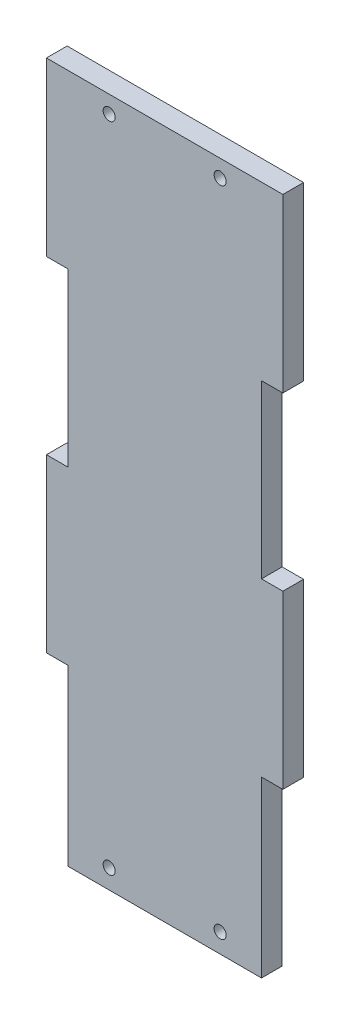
ISO-10303-21;
HEADER;
FILE_DESCRIPTION(('STEP AP214'),'2;1');
FILE_NAME('part.step','',(''),(''),'','','');
FILE_SCHEMA(('AUTOMOTIVE_DESIGN { 1 0 10303 214 1 1 1 1 }'));
ENDSEC;
DATA;
#1=APPLICATION_CONTEXT('core data for automotive mechanical design processes');
#2=APPLICATION_PROTOCOL_DEFINITION('international standard','automotive_design',2000,#1);
#3=PRODUCT_CONTEXT('',#1,'mechanical');
#4=PRODUCT('Part','Part','',(#3));
#5=PRODUCT_RELATED_PRODUCT_CATEGORY('part','',(#4));
#6=PRODUCT_DEFINITION_FORMATION('','',#4);
#7=PRODUCT_DEFINITION_CONTEXT('part definition',#1,'design');
#8=PRODUCT_DEFINITION('design','',#6,#7);
#9=PRODUCT_DEFINITION_SHAPE('','',#8);
#10=(LENGTH_UNIT() NAMED_UNIT(*) SI_UNIT(.MILLI.,.METRE.));
#11=(NAMED_UNIT(*) PLANE_ANGLE_UNIT() SI_UNIT($,.RADIAN.));
#12=(NAMED_UNIT(*) SI_UNIT($,.STERADIAN.) SOLID_ANGLE_UNIT());
#13=UNCERTAINTY_MEASURE_WITH_UNIT(LENGTH_MEASURE(1.E-05),#10,'distance_accuracy_value','');
#14=(GEOMETRIC_REPRESENTATION_CONTEXT(3) GLOBAL_UNCERTAINTY_ASSIGNED_CONTEXT((#13)) GLOBAL_UNIT_ASSIGNED_CONTEXT((#10,
#11,#12)) REPRESENTATION_CONTEXT('',''));
#15=CARTESIAN_POINT('',(0.,0.,0.));
#16=DIRECTION('',(0.,0.,1.));
#17=DIRECTION('',(1.,0.,0.));
#18=AXIS2_PLACEMENT_3D('',#15,#16,#17);
#19=CARTESIAN_POINT('',(0.,0.,6.));
#20=DIRECTION('',(0.,0.,1.));
#21=DIRECTION('',(1.,0.,0.));
#22=AXIS2_PLACEMENT_3D('',#19,#20,#21);
#23=PLANE('',#22);
#24=CARTESIAN_POINT('',(12.,5.60000000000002,6.));
#25=DIRECTION('',(0.,0.,1.));
#26=DIRECTION('',(-1.,0.,0.));
#27=AXIS2_PLACEMENT_3D('',#24,#25,#26);
#28=CIRCLE('',#27,1.75);
#29=CARTESIAN_POINT('',(10.25,5.60000000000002,6.));
#30=VERTEX_POINT('',#29);
#31=EDGE_CURVE('E407',#30,#30,#28,.T.);
#32=ORIENTED_EDGE('',*,*,#31,.F.);
#33=EDGE_LOOP('',(#32));
#34=FACE_BOUND('',#33,.T.);
#35=CARTESIAN_POINT('',(12.,195.,6.));
#36=DIRECTION('',(0.,0.,1.));
#37=DIRECTION('',(1.,0.,0.));
#38=AXIS2_PLACEMENT_3D('',#35,#36,#37);
#39=CIRCLE('',#38,1.75);
#40=CARTESIAN_POINT('',(13.75,195.,6.));
#41=VERTEX_POINT('',#40);
#42=EDGE_CURVE('E204',#41,#41,#39,.T.);
#43=ORIENTED_EDGE('',*,*,#42,.F.);
#44=EDGE_LOOP('',(#43));
#45=FACE_BOUND('',#44,.T.);
#46=DIRECTION('',(0.,-1.,0.));
#47=VECTOR('',#46,1.);
#48=CARTESIAN_POINT('',(0.,0.,6.));
#49=LINE('',#48,#47);
#50=CARTESIAN_POINT('',(0.,50.5,6.));
#51=VERTEX_POINT('',#50);
#52=CARTESIAN_POINT('',(0.,0.,6.));
#53=VERTEX_POINT('',#52);
#54=EDGE_CURVE('E247',#51,#53,#49,.T.);
#55=ORIENTED_EDGE('',*,*,#54,.T.);
#56=DIRECTION('',(1.,0.,0.));
#57=VECTOR('',#56,1.);
#58=CARTESIAN_POINT('',(0.,0.,6.));
#59=LINE('',#58,#57);
#60=CARTESIAN_POINT('',(56.2,0.,6.));
#61=VERTEX_POINT('',#60);
#62=EDGE_CURVE('E134',#53,#61,#59,.T.);
#63=ORIENTED_EDGE('',*,*,#62,.T.);
#64=DIRECTION('',(0.,1.,0.));
#65=VECTOR('',#64,1.);
#66=CARTESIAN_POINT('',(56.2,0.,6.));
#67=LINE('',#66,#65);
#68=CARTESIAN_POINT('',(56.2,50.5,6.));
#69=VERTEX_POINT('',#68);
#70=EDGE_CURVE('E300',#61,#69,#67,.T.);
#71=ORIENTED_EDGE('',*,*,#70,.T.);
#72=DIRECTION('',(1.,0.,0.));
#73=VECTOR('',#72,1.);
#74=CARTESIAN_POINT('',(56.2,50.5,6.));
#75=LINE('',#74,#73);
#76=CARTESIAN_POINT('',(62.4,50.5,6.));
#77=VERTEX_POINT('',#76);
#78=EDGE_CURVE('E320',#69,#77,#75,.T.);
#79=ORIENTED_EDGE('',*,*,#78,.T.);
#80=DIRECTION('',(0.,1.,0.));
#81=VECTOR('',#80,1.);
#82=CARTESIAN_POINT('',(62.4,50.5,6.));
#83=LINE('',#82,#81);
#84=CARTESIAN_POINT('',(62.4,100.3,6.));
#85=VERTEX_POINT('',#84);
#86=EDGE_CURVE('E316',#77,#85,#83,.T.);
#87=ORIENTED_EDGE('',*,*,#86,.T.);
#88=DIRECTION('',(-1.,0.,0.));
#89=VECTOR('',#88,1.);
#90=CARTESIAN_POINT('',(56.2,100.3,6.));
#91=LINE('',#90,#89);
#92=CARTESIAN_POINT('',(56.2,100.3,6.));
#93=VERTEX_POINT('',#92);
#94=EDGE_CURVE('E319',#85,#93,#91,.T.);
#95=ORIENTED_EDGE('',*,*,#94,.T.);
#96=DIRECTION('',(0.,1.,0.));
#97=VECTOR('',#96,1.);
#98=CARTESIAN_POINT('',(56.2,100.3,6.));
#99=LINE('',#98,#97);
#100=CARTESIAN_POINT('',(56.2,150.1,6.));
#101=VERTEX_POINT('',#100);
#102=EDGE_CURVE('E324',#93,#101,#99,.T.);
#103=ORIENTED_EDGE('',*,*,#102,.T.);
#104=DIRECTION('',(1.,0.,0.));
#105=VECTOR('',#104,1.);
#106=CARTESIAN_POINT('',(56.2,150.1,6.));
#107=LINE('',#106,#105);
#108=CARTESIAN_POINT('',(62.4,150.1,6.));
#109=VERTEX_POINT('',#108);
#110=EDGE_CURVE('E331',#101,#109,#107,.T.);
#111=ORIENTED_EDGE('',*,*,#110,.T.);
#112=DIRECTION('',(0.,1.,0.));
#113=VECTOR('',#112,1.);
#114=CARTESIAN_POINT('',(62.4,200.,6.));
#115=LINE('',#114,#113);
#116=CARTESIAN_POINT('',(62.4,200.,6.));
#117=VERTEX_POINT('',#116);
#118=EDGE_CURVE('E334',#109,#117,#115,.T.);
#119=ORIENTED_EDGE('',*,*,#118,.T.);
#120=DIRECTION('',(-1.,0.,0.));
#121=VECTOR('',#120,1.);
#122=CARTESIAN_POINT('',(56.2,200.,6.));
#123=LINE('',#122,#121);
#124=CARTESIAN_POINT('',(-6.2,200.,6.));
#125=VERTEX_POINT('',#124);
#126=EDGE_CURVE('E337',#117,#125,#123,.T.);
#127=ORIENTED_EDGE('',*,*,#126,.T.);
#128=DIRECTION('',(0.,-1.,0.));
#129=VECTOR('',#128,1.);
#130=CARTESIAN_POINT('',(-6.2,150.1,6.));
#131=LINE('',#130,#129);
#132=CARTESIAN_POINT('',(-6.2,150.1,6.));
#133=VERTEX_POINT('',#132);
#134=EDGE_CURVE('E340',#125,#133,#131,.T.);
#135=ORIENTED_EDGE('',*,*,#134,.T.);
#136=DIRECTION('',(1.,0.,0.));
#137=VECTOR('',#136,1.);
#138=CARTESIAN_POINT('',(0.,150.1,6.));
#139=LINE('',#138,#137);
#140=CARTESIAN_POINT('',(0.,150.1,6.));
#141=VERTEX_POINT('',#140);
#142=EDGE_CURVE('E343',#133,#141,#139,.T.);
#143=ORIENTED_EDGE('',*,*,#142,.T.);
#144=DIRECTION('',(0.,-1.,0.));
#145=VECTOR('',#144,1.);
#146=CARTESIAN_POINT('',(0.,100.3,6.));
#147=LINE('',#146,#145);
#148=CARTESIAN_POINT('',(0.,100.3,6.));
#149=VERTEX_POINT('',#148);
#150=EDGE_CURVE('E177',#141,#149,#147,.T.);
#151=ORIENTED_EDGE('',*,*,#150,.T.);
#152=DIRECTION('',(-1.,0.,0.));
#153=VECTOR('',#152,1.);
#154=CARTESIAN_POINT('',(0.,100.3,6.));
#155=LINE('',#154,#153);
#156=CARTESIAN_POINT('',(-6.2,100.3,6.));
#157=VERTEX_POINT('',#156);
#158=EDGE_CURVE('E171',#149,#157,#155,.T.);
#159=ORIENTED_EDGE('',*,*,#158,.T.);
#160=DIRECTION('',(0.,-1.,0.));
#161=VECTOR('',#160,1.);
#162=CARTESIAN_POINT('',(-6.2,50.5,6.));
#163=LINE('',#162,#161);
#164=CARTESIAN_POINT('',(-6.2,50.5,6.));
#165=VERTEX_POINT('',#164);
#166=EDGE_CURVE('E175',#157,#165,#163,.T.);
#167=ORIENTED_EDGE('',*,*,#166,.T.);
#168=DIRECTION('',(1.,0.,0.));
#169=VECTOR('',#168,1.);
#170=CARTESIAN_POINT('',(0.,50.5,6.));
#171=LINE('',#170,#169);
#172=EDGE_CURVE('E67',#165,#51,#171,.T.);
#173=ORIENTED_EDGE('',*,*,#172,.T.);
#174=EDGE_LOOP('',(#55,#63,#71,#79,#87,#95,#103,#111,#119,#127,#135,#143,#151,#159,#167,#173));
#175=FACE_BOUND('',#174,.T.);
#176=CARTESIAN_POINT('',(44.2,195.,6.));
#177=DIRECTION('',(0.,0.,1.));
#178=DIRECTION('',(-1.,0.,0.));
#179=AXIS2_PLACEMENT_3D('',#176,#177,#178);
#180=CIRCLE('',#179,1.75);
#181=CARTESIAN_POINT('',(42.45,195.,6.));
#182=VERTEX_POINT('',#181);
#183=EDGE_CURVE('E415',#182,#182,#180,.T.);
#184=ORIENTED_EDGE('',*,*,#183,.F.);
#185=EDGE_LOOP('',(#184));
#186=FACE_BOUND('',#185,.T.);
#187=CARTESIAN_POINT('',(44.2,5.60000000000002,6.));
#188=DIRECTION('',(0.,0.,1.));
#189=DIRECTION('',(1.,0.,0.));
#190=AXIS2_PLACEMENT_3D('',#187,#188,#189);
#191=CIRCLE('',#190,1.75);
#192=CARTESIAN_POINT('',(45.95,5.60000000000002,6.));
#193=VERTEX_POINT('',#192);
#194=EDGE_CURVE('E396',#193,#193,#191,.T.);
#195=ORIENTED_EDGE('',*,*,#194,.F.);
#196=EDGE_LOOP('',(#195));
#197=FACE_BOUND('',#196,.T.);
#198=ADVANCED_FACE('F49',(#34,#45,#175,#186,#197),#23,.T.);
#199=CARTESIAN_POINT('',(0.,0.,0.));
#200=DIRECTION('',(0.,0.,1.));
#201=DIRECTION('',(1.,0.,0.));
#202=AXIS2_PLACEMENT_3D('',#199,#200,#201);
#203=PLANE('',#202);
#204=DIRECTION('',(0.,-1.,0.));
#205=VECTOR('',#204,1.);
#206=CARTESIAN_POINT('',(0.,0.,0.));
#207=LINE('',#206,#205);
#208=CARTESIAN_POINT('',(0.,50.5,0.));
#209=VERTEX_POINT('',#208);
#210=CARTESIAN_POINT('',(0.,0.,0.));
#211=VERTEX_POINT('',#210);
#212=EDGE_CURVE('E199',#209,#211,#207,.T.);
#213=ORIENTED_EDGE('',*,*,#212,.F.);
#214=DIRECTION('',(1.,0.,0.));
#215=VECTOR('',#214,1.);
#216=CARTESIAN_POINT('',(0.,50.5,0.));
#217=LINE('',#216,#215);
#218=CARTESIAN_POINT('',(-6.2,50.5,0.));
#219=VERTEX_POINT('',#218);
#220=EDGE_CURVE('E126',#219,#209,#217,.T.);
#221=ORIENTED_EDGE('',*,*,#220,.F.);
#222=DIRECTION('',(0.,-1.,0.));
#223=VECTOR('',#222,1.);
#224=CARTESIAN_POINT('',(-6.2,50.5,0.));
#225=LINE('',#224,#223);
#226=CARTESIAN_POINT('',(-6.2,100.3,0.));
#227=VERTEX_POINT('',#226);
#228=EDGE_CURVE('E120',#227,#219,#225,.T.);
#229=ORIENTED_EDGE('',*,*,#228,.F.);
#230=DIRECTION('',(-1.,0.,0.));
#231=VECTOR('',#230,1.);
#232=CARTESIAN_POINT('',(0.,100.3,0.));
#233=LINE('',#232,#231);
#234=CARTESIAN_POINT('',(0.,100.3,0.));
#235=VERTEX_POINT('',#234);
#236=EDGE_CURVE('E186',#235,#227,#233,.T.);
#237=ORIENTED_EDGE('',*,*,#236,.F.);
#238=DIRECTION('',(0.,-1.,0.));
#239=VECTOR('',#238,1.);
#240=CARTESIAN_POINT('',(0.,100.3,0.));
#241=LINE('',#240,#239);
#242=CARTESIAN_POINT('',(0.,150.1,0.));
#243=VERTEX_POINT('',#242);
#244=EDGE_CURVE('E238',#243,#235,#241,.T.);
#245=ORIENTED_EDGE('',*,*,#244,.F.);
#246=DIRECTION('',(1.,0.,0.));
#247=VECTOR('',#246,1.);
#248=CARTESIAN_POINT('',(0.,150.1,0.));
#249=LINE('',#248,#247);
#250=CARTESIAN_POINT('',(-6.2,150.1,0.));
#251=VERTEX_POINT('',#250);
#252=EDGE_CURVE('E235',#251,#243,#249,.T.);
#253=ORIENTED_EDGE('',*,*,#252,.F.);
#254=DIRECTION('',(0.,-1.,0.));
#255=VECTOR('',#254,1.);
#256=CARTESIAN_POINT('',(-6.2,150.1,0.));
#257=LINE('',#256,#255);
#258=CARTESIAN_POINT('',(-6.2,200.,0.));
#259=VERTEX_POINT('',#258);
#260=EDGE_CURVE('E232',#259,#251,#257,.T.);
#261=ORIENTED_EDGE('',*,*,#260,.F.);
#262=DIRECTION('',(-1.,0.,0.));
#263=VECTOR('',#262,1.);
#264=CARTESIAN_POINT('',(0.,200.,0.));
#265=LINE('',#264,#263);
#266=CARTESIAN_POINT('',(62.4,200.,0.));
#267=VERTEX_POINT('',#266);
#268=EDGE_CURVE('E229',#267,#259,#265,.T.);
#269=ORIENTED_EDGE('',*,*,#268,.F.);
#270=DIRECTION('',(0.,1.,0.));
#271=VECTOR('',#270,1.);
#272=CARTESIAN_POINT('',(62.4,200.,0.));
#273=LINE('',#272,#271);
#274=CARTESIAN_POINT('',(62.4,150.1,0.));
#275=VERTEX_POINT('',#274);
#276=EDGE_CURVE('E225',#275,#267,#273,.T.);
#277=ORIENTED_EDGE('',*,*,#276,.F.);
#278=DIRECTION('',(1.,0.,0.));
#279=VECTOR('',#278,1.);
#280=CARTESIAN_POINT('',(56.2,150.1,0.));
#281=LINE('',#280,#279);
#282=CARTESIAN_POINT('',(56.2,150.1,0.));
#283=VERTEX_POINT('',#282);
#284=EDGE_CURVE('E222',#283,#275,#281,.T.);
#285=ORIENTED_EDGE('',*,*,#284,.F.);
#286=DIRECTION('',(0.,1.,0.));
#287=VECTOR('',#286,1.);
#288=CARTESIAN_POINT('',(56.2,100.3,0.));
#289=LINE('',#288,#287);
#290=CARTESIAN_POINT('',(56.2,100.3,0.));
#291=VERTEX_POINT('',#290);
#292=EDGE_CURVE('E219',#291,#283,#289,.T.);
#293=ORIENTED_EDGE('',*,*,#292,.F.);
#294=DIRECTION('',(-1.,0.,0.));
#295=VECTOR('',#294,1.);
#296=CARTESIAN_POINT('',(56.2,100.3,0.));
#297=LINE('',#296,#295);
#298=CARTESIAN_POINT('',(62.4,100.3,0.));
#299=VERTEX_POINT('',#298);
#300=EDGE_CURVE('E216',#299,#291,#297,.T.);
#301=ORIENTED_EDGE('',*,*,#300,.F.);
#302=DIRECTION('',(0.,1.,0.));
#303=VECTOR('',#302,1.);
#304=CARTESIAN_POINT('',(62.4,50.5,0.));
#305=LINE('',#304,#303);
#306=CARTESIAN_POINT('',(62.4,50.5,0.));
#307=VERTEX_POINT('',#306);
#308=EDGE_CURVE('E213',#307,#299,#305,.T.);
#309=ORIENTED_EDGE('',*,*,#308,.F.);
#310=DIRECTION('',(1.,0.,0.));
#311=VECTOR('',#310,1.);
#312=CARTESIAN_POINT('',(56.2,50.5,0.));
#313=LINE('',#312,#311);
#314=CARTESIAN_POINT('',(56.2,50.5,0.));
#315=VERTEX_POINT('',#314);
#316=EDGE_CURVE('E210',#315,#307,#313,.T.);
#317=ORIENTED_EDGE('',*,*,#316,.F.);
#318=DIRECTION('',(0.,1.,0.));
#319=VECTOR('',#318,1.);
#320=CARTESIAN_POINT('',(56.2,0.,0.));
#321=LINE('',#320,#319);
#322=CARTESIAN_POINT('',(56.2,0.,0.));
#323=VERTEX_POINT('',#322);
#324=EDGE_CURVE('E207',#323,#315,#321,.T.);
#325=ORIENTED_EDGE('',*,*,#324,.F.);
#326=DIRECTION('',(1.,0.,0.));
#327=VECTOR('',#326,1.);
#328=CARTESIAN_POINT('',(0.,0.,0.));
#329=LINE('',#328,#327);
#330=EDGE_CURVE('E203',#211,#323,#329,.T.);
#331=ORIENTED_EDGE('',*,*,#330,.F.);
#332=EDGE_LOOP('',(#213,#221,#229,#237,#245,#253,#261,#269,#277,#285,#293,#301,#309,#317,#325,#331));
#333=FACE_BOUND('',#332,.T.);
#334=CARTESIAN_POINT('',(12.,195.,0.));
#335=DIRECTION('',(0.,0.,1.));
#336=DIRECTION('',(1.,0.,0.));
#337=AXIS2_PLACEMENT_3D('',#334,#335,#336);
#338=CIRCLE('',#337,1.75);
#339=CARTESIAN_POINT('',(13.75,195.,0.));
#340=VERTEX_POINT('',#339);
#341=EDGE_CURVE('E419',#340,#340,#338,.T.);
#342=ORIENTED_EDGE('',*,*,#341,.T.);
#343=EDGE_LOOP('',(#342));
#344=FACE_BOUND('',#343,.T.);
#345=CARTESIAN_POINT('',(44.2,195.,0.));
#346=DIRECTION('',(0.,0.,1.));
#347=DIRECTION('',(-1.,0.,0.));
#348=AXIS2_PLACEMENT_3D('',#345,#346,#347);
#349=CIRCLE('',#348,1.75);
#350=CARTESIAN_POINT('',(42.45,195.,0.));
#351=VERTEX_POINT('',#350);
#352=EDGE_CURVE('E411',#351,#351,#349,.T.);
#353=ORIENTED_EDGE('',*,*,#352,.T.);
#354=EDGE_LOOP('',(#353));
#355=FACE_BOUND('',#354,.T.);
#356=CARTESIAN_POINT('',(12.,5.60000000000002,0.));
#357=DIRECTION('',(0.,0.,1.));
#358=DIRECTION('',(-1.,0.,0.));
#359=AXIS2_PLACEMENT_3D('',#356,#357,#358);
#360=CIRCLE('',#359,1.75);
#361=CARTESIAN_POINT('',(10.25,5.60000000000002,0.));
#362=VERTEX_POINT('',#361);
#363=EDGE_CURVE('E404',#362,#362,#360,.T.);
#364=ORIENTED_EDGE('',*,*,#363,.T.);
#365=EDGE_LOOP('',(#364));
#366=FACE_BOUND('',#365,.T.);
#367=CARTESIAN_POINT('',(44.2,5.60000000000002,0.));
#368=DIRECTION('',(0.,0.,1.));
#369=DIRECTION('',(1.,0.,0.));
#370=AXIS2_PLACEMENT_3D('',#367,#368,#369);
#371=CIRCLE('',#370,1.75);
#372=CARTESIAN_POINT('',(45.95,5.60000000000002,0.));
#373=VERTEX_POINT('',#372);
#374=EDGE_CURVE('E399',#373,#373,#371,.T.);
#375=ORIENTED_EDGE('',*,*,#374,.T.);
#376=EDGE_LOOP('',(#375));
#377=FACE_BOUND('',#376,.T.);
#378=ADVANCED_FACE('F304',(#333,#344,#355,#366,#377),#203,.F.);
#379=CARTESIAN_POINT('',(0.,0.,6.));
#380=DIRECTION('',(1.,0.,0.));
#381=DIRECTION('',(0.,0.,-1.));
#382=AXIS2_PLACEMENT_3D('',#379,#380,#381);
#383=PLANE('',#382);
#384=ORIENTED_EDGE('',*,*,#212,.T.);
#385=DIRECTION('',(0.,0.,-1.));
#386=VECTOR('',#385,1.);
#387=CARTESIAN_POINT('',(0.,0.,6.));
#388=LINE('',#387,#386);
#389=EDGE_CURVE('E11',#53,#211,#388,.T.);
#390=ORIENTED_EDGE('',*,*,#389,.F.);
#391=ORIENTED_EDGE('',*,*,#54,.F.);
#392=DIRECTION('',(0.,0.,-1.));
#393=VECTOR('',#392,1.);
#394=CARTESIAN_POINT('',(0.,50.5,6.));
#395=LINE('',#394,#393);
#396=EDGE_CURVE('E195',#51,#209,#395,.T.);
#397=ORIENTED_EDGE('',*,*,#396,.T.);
#398=EDGE_LOOP('',(#384,#390,#391,#397));
#399=FACE_BOUND('',#398,.T.);
#400=ADVANCED_FACE('F51',(#399),#383,.F.);
#401=CARTESIAN_POINT('',(0.,0.,6.));
#402=DIRECTION('',(0.,1.,0.));
#403=DIRECTION('',(0.,0.,1.));
#404=AXIS2_PLACEMENT_3D('',#401,#402,#403);
#405=PLANE('',#404);
#406=ORIENTED_EDGE('',*,*,#330,.T.);
#407=DIRECTION('',(0.,0.,-1.));
#408=VECTOR('',#407,1.);
#409=CARTESIAN_POINT('',(56.2,0.,6.));
#410=LINE('',#409,#408);
#411=EDGE_CURVE('E59',#61,#323,#410,.T.);
#412=ORIENTED_EDGE('',*,*,#411,.F.);
#413=ORIENTED_EDGE('',*,*,#62,.F.);
#414=ORIENTED_EDGE('',*,*,#389,.T.);
#415=EDGE_LOOP('',(#406,#412,#413,#414));
#416=FACE_BOUND('',#415,.T.);
#417=ADVANCED_FACE('F575',(#416),#405,.F.);
#418=CARTESIAN_POINT('',(56.2,0.,6.));
#419=DIRECTION('',(-1.,0.,0.));
#420=DIRECTION('',(0.,0.,1.));
#421=AXIS2_PLACEMENT_3D('',#418,#419,#420);
#422=PLANE('',#421);
#423=ORIENTED_EDGE('',*,*,#324,.T.);
#424=DIRECTION('',(0.,0.,-1.));
#425=VECTOR('',#424,1.);
#426=CARTESIAN_POINT('',(56.2,50.5,6.));
#427=LINE('',#426,#425);
#428=EDGE_CURVE('E290',#69,#315,#427,.T.);
#429=ORIENTED_EDGE('',*,*,#428,.F.);
#430=ORIENTED_EDGE('',*,*,#70,.F.);
#431=ORIENTED_EDGE('',*,*,#411,.T.);
#432=EDGE_LOOP('',(#423,#429,#430,#431));
#433=FACE_BOUND('',#432,.T.);
#434=ADVANCED_FACE('F298',(#433),#422,.F.);
#435=CARTESIAN_POINT('',(56.2,50.5,6.));
#436=DIRECTION('',(0.,1.,0.));
#437=DIRECTION('',(0.,0.,1.));
#438=AXIS2_PLACEMENT_3D('',#435,#436,#437);
#439=PLANE('',#438);
#440=ORIENTED_EDGE('',*,*,#316,.T.);
#441=DIRECTION('',(0.,0.,-1.));
#442=VECTOR('',#441,1.);
#443=CARTESIAN_POINT('',(62.4,50.5,6.));
#444=LINE('',#443,#442);
#445=EDGE_CURVE('E286',#77,#307,#444,.T.);
#446=ORIENTED_EDGE('',*,*,#445,.F.);
#447=ORIENTED_EDGE('',*,*,#78,.F.);
#448=ORIENTED_EDGE('',*,*,#428,.T.);
#449=EDGE_LOOP('',(#440,#446,#447,#448));
#450=FACE_BOUND('',#449,.T.);
#451=ADVANCED_FACE('F310',(#450),#439,.F.);
#452=CARTESIAN_POINT('',(62.4,50.5,6.));
#453=DIRECTION('',(-1.,0.,0.));
#454=DIRECTION('',(0.,0.,1.));
#455=AXIS2_PLACEMENT_3D('',#452,#453,#454);
#456=PLANE('',#455);
#457=ORIENTED_EDGE('',*,*,#308,.T.);
#458=DIRECTION('',(0.,0.,-1.));
#459=VECTOR('',#458,1.);
#460=CARTESIAN_POINT('',(62.4,100.3,6.));
#461=LINE('',#460,#459);
#462=EDGE_CURVE('E282',#85,#299,#461,.T.);
#463=ORIENTED_EDGE('',*,*,#462,.F.);
#464=ORIENTED_EDGE('',*,*,#86,.F.);
#465=ORIENTED_EDGE('',*,*,#445,.T.);
#466=EDGE_LOOP('',(#457,#463,#464,#465));
#467=FACE_BOUND('',#466,.T.);
#468=ADVANCED_FACE('F314',(#467),#456,.F.);
#469=CARTESIAN_POINT('',(56.2,100.3,6.));
#470=DIRECTION('',(0.,-1.,0.));
#471=DIRECTION('',(0.,0.,-1.));
#472=AXIS2_PLACEMENT_3D('',#469,#470,#471);
#473=PLANE('',#472);
#474=ORIENTED_EDGE('',*,*,#300,.T.);
#475=DIRECTION('',(0.,0.,-1.));
#476=VECTOR('',#475,1.);
#477=CARTESIAN_POINT('',(56.2,100.3,6.));
#478=LINE('',#477,#476);
#479=EDGE_CURVE('E278',#93,#291,#478,.T.);
#480=ORIENTED_EDGE('',*,*,#479,.F.);
#481=ORIENTED_EDGE('',*,*,#94,.F.);
#482=ORIENTED_EDGE('',*,*,#462,.T.);
#483=EDGE_LOOP('',(#474,#480,#481,#482));
#484=FACE_BOUND('',#483,.T.);
#485=ADVANCED_FACE('F540',(#484),#473,.F.);
#486=CARTESIAN_POINT('',(56.2,100.3,6.));
#487=DIRECTION('',(-1.,0.,0.));
#488=DIRECTION('',(0.,-1.,0.));
#489=AXIS2_PLACEMENT_3D('',#486,#487,#488);
#490=PLANE('',#489);
#491=ORIENTED_EDGE('',*,*,#292,.T.);
#492=DIRECTION('',(0.,0.,-1.));
#493=VECTOR('',#492,1.);
#494=CARTESIAN_POINT('',(56.2,150.1,6.));
#495=LINE('',#494,#493);
#496=EDGE_CURVE('E274',#101,#283,#495,.T.);
#497=ORIENTED_EDGE('',*,*,#496,.F.);
#498=ORIENTED_EDGE('',*,*,#102,.F.);
#499=ORIENTED_EDGE('',*,*,#479,.T.);
#500=EDGE_LOOP('',(#491,#497,#498,#499));
#501=FACE_BOUND('',#500,.T.);
#502=ADVANCED_FACE('F530',(#501),#490,.F.);
#503=CARTESIAN_POINT('',(56.2,150.1,6.));
#504=DIRECTION('',(0.,1.,0.));
#505=DIRECTION('',(0.,0.,1.));
#506=AXIS2_PLACEMENT_3D('',#503,#504,#505);
#507=PLANE('',#506);
#508=ORIENTED_EDGE('',*,*,#284,.T.);
#509=DIRECTION('',(0.,0.,-1.));
#510=VECTOR('',#509,1.);
#511=CARTESIAN_POINT('',(62.4,150.1,6.));
#512=LINE('',#511,#510);
#513=EDGE_CURVE('E270',#109,#275,#512,.T.);
#514=ORIENTED_EDGE('',*,*,#513,.F.);
#515=ORIENTED_EDGE('',*,*,#110,.F.);
#516=ORIENTED_EDGE('',*,*,#496,.T.);
#517=EDGE_LOOP('',(#508,#514,#515,#516));
#518=FACE_BOUND('',#517,.T.);
#519=ADVANCED_FACE('F520',(#518),#507,.F.);
#520=CARTESIAN_POINT('',(62.4,200.,6.));
#521=DIRECTION('',(-1.,0.,0.));
#522=DIRECTION('',(0.,-1.,0.));
#523=AXIS2_PLACEMENT_3D('',#520,#521,#522);
#524=PLANE('',#523);
#525=ORIENTED_EDGE('',*,*,#276,.T.);
#526=DIRECTION('',(0.,0.,-1.));
#527=VECTOR('',#526,1.);
#528=CARTESIAN_POINT('',(62.4,200.,6.));
#529=LINE('',#528,#527);
#530=EDGE_CURVE('E266',#117,#267,#529,.T.);
#531=ORIENTED_EDGE('',*,*,#530,.F.);
#532=ORIENTED_EDGE('',*,*,#118,.F.);
#533=ORIENTED_EDGE('',*,*,#513,.T.);
#534=EDGE_LOOP('',(#525,#531,#532,#533));
#535=FACE_BOUND('',#534,.T.);
#536=ADVANCED_FACE('F510',(#535),#524,.F.);
#537=CARTESIAN_POINT('',(0.,200.,6.));
#538=DIRECTION('',(0.,-1.,0.));
#539=DIRECTION('',(0.,0.,-1.));
#540=AXIS2_PLACEMENT_3D('',#537,#538,#539);
#541=PLANE('',#540);
#542=ORIENTED_EDGE('',*,*,#268,.T.);
#543=DIRECTION('',(0.,0.,-1.));
#544=VECTOR('',#543,1.);
#545=CARTESIAN_POINT('',(-6.2,200.,6.));
#546=LINE('',#545,#544);
#547=EDGE_CURVE('E262',#125,#259,#546,.T.);
#548=ORIENTED_EDGE('',*,*,#547,.F.);
#549=ORIENTED_EDGE('',*,*,#126,.F.);
#550=ORIENTED_EDGE('',*,*,#530,.T.);
#551=EDGE_LOOP('',(#542,#548,#549,#550));
#552=FACE_BOUND('',#551,.T.);
#553=ADVANCED_FACE('F500',(#552),#541,.F.);
#554=CARTESIAN_POINT('',(-6.2,150.1,6.));
#555=DIRECTION('',(1.,0.,0.));
#556=DIRECTION('',(0.,1.,0.));
#557=AXIS2_PLACEMENT_3D('',#554,#555,#556);
#558=PLANE('',#557);
#559=ORIENTED_EDGE('',*,*,#260,.T.);
#560=DIRECTION('',(0.,0.,-1.));
#561=VECTOR('',#560,1.);
#562=CARTESIAN_POINT('',(-6.2,150.1,6.));
#563=LINE('',#562,#561);
#564=EDGE_CURVE('E258',#133,#251,#563,.T.);
#565=ORIENTED_EDGE('',*,*,#564,.F.);
#566=ORIENTED_EDGE('',*,*,#134,.F.);
#567=ORIENTED_EDGE('',*,*,#547,.T.);
#568=EDGE_LOOP('',(#559,#565,#566,#567));
#569=FACE_BOUND('',#568,.T.);
#570=ADVANCED_FACE('F491',(#569),#558,.F.);
#571=CARTESIAN_POINT('',(0.,150.1,6.));
#572=DIRECTION('',(0.,1.,0.));
#573=DIRECTION('',(0.,0.,1.));
#574=AXIS2_PLACEMENT_3D('',#571,#572,#573);
#575=PLANE('',#574);
#576=ORIENTED_EDGE('',*,*,#252,.T.);
#577=DIRECTION('',(0.,0.,-1.));
#578=VECTOR('',#577,1.);
#579=CARTESIAN_POINT('',(0.,150.1,6.));
#580=LINE('',#579,#578);
#581=EDGE_CURVE('E254',#141,#243,#580,.T.);
#582=ORIENTED_EDGE('',*,*,#581,.F.);
#583=ORIENTED_EDGE('',*,*,#142,.F.);
#584=ORIENTED_EDGE('',*,*,#564,.T.);
#585=EDGE_LOOP('',(#576,#582,#583,#584));
#586=FACE_BOUND('',#585,.T.);
#587=ADVANCED_FACE('F351',(#586),#575,.F.);
#588=CARTESIAN_POINT('',(0.,100.3,6.));
#589=DIRECTION('',(1.,0.,0.));
#590=DIRECTION('',(0.,1.,0.));
#591=AXIS2_PLACEMENT_3D('',#588,#589,#590);
#592=PLANE('',#591);
#593=ORIENTED_EDGE('',*,*,#244,.T.);
#594=DIRECTION('',(0.,0.,-1.));
#595=VECTOR('',#594,1.);
#596=CARTESIAN_POINT('',(0.,100.3,6.));
#597=LINE('',#596,#595);
#598=EDGE_CURVE('E188',#149,#235,#597,.T.);
#599=ORIENTED_EDGE('',*,*,#598,.F.);
#600=ORIENTED_EDGE('',*,*,#150,.F.);
#601=ORIENTED_EDGE('',*,*,#581,.T.);
#602=EDGE_LOOP('',(#593,#599,#600,#601));
#603=FACE_BOUND('',#602,.T.);
#604=ADVANCED_FACE('F355',(#603),#592,.F.);
#605=CARTESIAN_POINT('',(0.,100.3,6.));
#606=DIRECTION('',(0.,-1.,0.));
#607=DIRECTION('',(0.,0.,-1.));
#608=AXIS2_PLACEMENT_3D('',#605,#606,#607);
#609=PLANE('',#608);
#610=ORIENTED_EDGE('',*,*,#236,.T.);
#611=DIRECTION('',(0.,0.,-1.));
#612=VECTOR('',#611,1.);
#613=CARTESIAN_POINT('',(-6.2,100.3,6.));
#614=LINE('',#613,#612);
#615=EDGE_CURVE('E183',#157,#227,#614,.T.);
#616=ORIENTED_EDGE('',*,*,#615,.F.);
#617=ORIENTED_EDGE('',*,*,#158,.F.);
#618=ORIENTED_EDGE('',*,*,#598,.T.);
#619=EDGE_LOOP('',(#610,#616,#617,#618));
#620=FACE_BOUND('',#619,.T.);
#621=ADVANCED_FACE('F184',(#620),#609,.F.);
#622=CARTESIAN_POINT('',(-6.2,50.5,6.));
#623=DIRECTION('',(1.,0.,0.));
#624=DIRECTION('',(0.,0.,-1.));
#625=AXIS2_PLACEMENT_3D('',#622,#623,#624);
#626=PLANE('',#625);
#627=ORIENTED_EDGE('',*,*,#228,.T.);
#628=DIRECTION('',(0.,0.,-1.));
#629=VECTOR('',#628,1.);
#630=CARTESIAN_POINT('',(-6.2,50.5,6.));
#631=LINE('',#630,#629);
#632=EDGE_CURVE('E189',#165,#219,#631,.T.);
#633=ORIENTED_EDGE('',*,*,#632,.F.);
#634=ORIENTED_EDGE('',*,*,#166,.F.);
#635=ORIENTED_EDGE('',*,*,#615,.T.);
#636=EDGE_LOOP('',(#627,#633,#634,#635));
#637=FACE_BOUND('',#636,.T.);
#638=ADVANCED_FACE('F191',(#637),#626,.F.);
#639=CARTESIAN_POINT('',(0.,50.5,6.));
#640=DIRECTION('',(0.,1.,0.));
#641=DIRECTION('',(0.,0.,1.));
#642=AXIS2_PLACEMENT_3D('',#639,#640,#641);
#643=PLANE('',#642);
#644=ORIENTED_EDGE('',*,*,#220,.T.);
#645=ORIENTED_EDGE('',*,*,#396,.F.);
#646=ORIENTED_EDGE('',*,*,#172,.F.);
#647=ORIENTED_EDGE('',*,*,#632,.T.);
#648=EDGE_LOOP('',(#644,#645,#646,#647));
#649=FACE_BOUND('',#648,.T.);
#650=ADVANCED_FACE('F359',(#649),#643,.F.);
#651=CARTESIAN_POINT('',(12.,195.,6.));
#652=DIRECTION('',(0.,0.,-1.));
#653=DIRECTION('',(-1.,0.,0.));
#654=AXIS2_PLACEMENT_3D('',#651,#652,#653);
#655=CYLINDRICAL_SURFACE('',#654,1.75);
#656=ORIENTED_EDGE('',*,*,#42,.T.);
#657=EDGE_LOOP('',(#656));
#658=FACE_BOUND('',#657,.T.);
#659=ORIENTED_EDGE('',*,*,#341,.F.);
#660=EDGE_LOOP('',(#659));
#661=FACE_BOUND('',#660,.T.);
#662=ADVANCED_FACE('F361',(#658,#661),#655,.F.);
#663=CARTESIAN_POINT('',(44.2,195.,6.));
#664=DIRECTION('',(0.,0.,-1.));
#665=DIRECTION('',(-1.,0.,0.));
#666=AXIS2_PLACEMENT_3D('',#663,#664,#665);
#667=CYLINDRICAL_SURFACE('',#666,1.75);
#668=ORIENTED_EDGE('',*,*,#183,.T.);
#669=EDGE_LOOP('',(#668));
#670=FACE_BOUND('',#669,.T.);
#671=ORIENTED_EDGE('',*,*,#352,.F.);
#672=EDGE_LOOP('',(#671));
#673=FACE_BOUND('',#672,.T.);
#674=ADVANCED_FACE('F367',(#670,#673),#667,.F.);
#675=CARTESIAN_POINT('',(12.,5.60000000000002,6.));
#676=DIRECTION('',(0.,0.,-1.));
#677=DIRECTION('',(-1.,0.,0.));
#678=AXIS2_PLACEMENT_3D('',#675,#676,#677);
#679=CYLINDRICAL_SURFACE('',#678,1.75);
#680=ORIENTED_EDGE('',*,*,#31,.T.);
#681=EDGE_LOOP('',(#680));
#682=FACE_BOUND('',#681,.T.);
#683=ORIENTED_EDGE('',*,*,#363,.F.);
#684=EDGE_LOOP('',(#683));
#685=FACE_BOUND('',#684,.T.);
#686=ADVANCED_FACE('F383',(#682,#685),#679,.F.);
#687=CARTESIAN_POINT('',(44.2,5.60000000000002,6.));
#688=DIRECTION('',(0.,0.,-1.));
#689=DIRECTION('',(-1.,0.,0.));
#690=AXIS2_PLACEMENT_3D('',#687,#688,#689);
#691=CYLINDRICAL_SURFACE('',#690,1.75);
#692=ORIENTED_EDGE('',*,*,#194,.T.);
#693=EDGE_LOOP('',(#692));
#694=FACE_BOUND('',#693,.T.);
#695=ORIENTED_EDGE('',*,*,#374,.F.);
#696=EDGE_LOOP('',(#695));
#697=FACE_BOUND('',#696,.T.);
#698=ADVANCED_FACE('F387',(#694,#697),#691,.F.);
#699=CLOSED_SHELL('',(#198,#378,#400,#417,#434,#451,#468,#485,#502,#519,#536,#553,#570,#587,
#604,#621,#638,#650,#662,#674,#686,#698));
#700=MANIFOLD_SOLID_BREP('B2',#699);
#701=ADVANCED_BREP_SHAPE_REPRESENTATION('',(#18,#700),#14);
#702=SHAPE_DEFINITION_REPRESENTATION(#9,#701);
ENDSEC;
END-ISO-10303-21;
